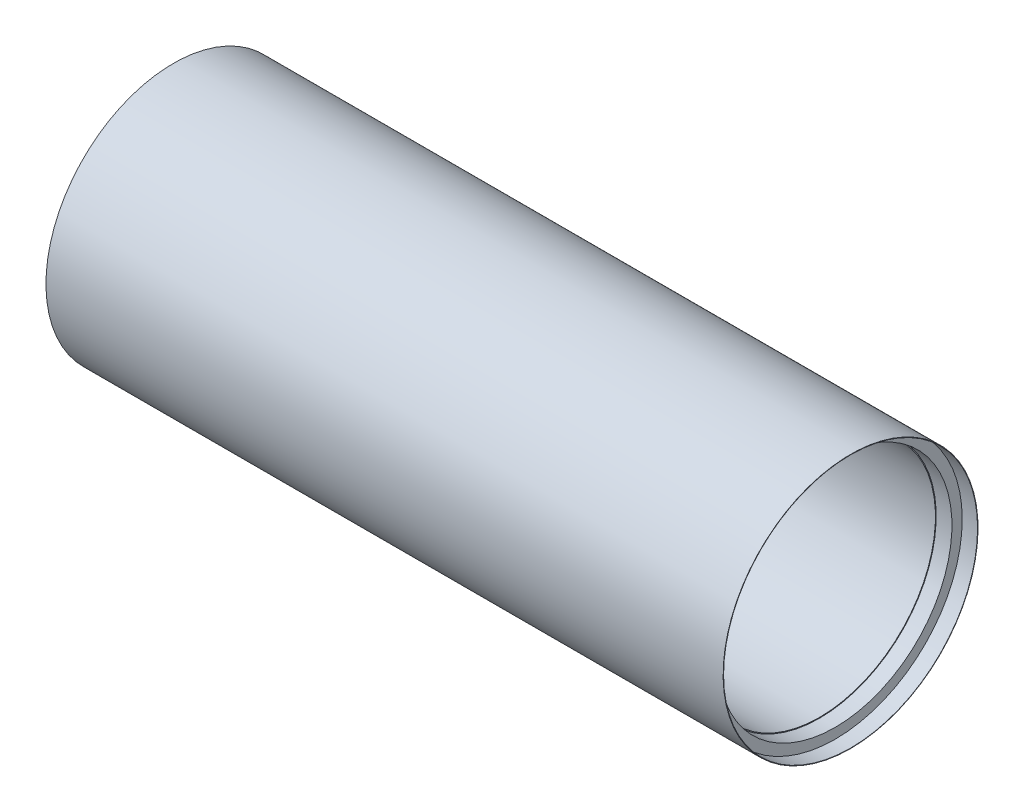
from build123d import *


with BuildPart() as part:
    # Sketch1 → Revolve1 (revolve)
    with BuildSketch(Plane.XY, mode=Mode.PRIVATE) as revolve1_sk:
        Polygon((0, 83.9724), (10.16, 83.9724), (10.16, 77.2414), (20.574, 77.2414), (20.574, 76.7334), (427.5582, 76.7334), (427.5582, 77.2414), (437.9722, 77.2414), (437.9722, 84.0486), (448.1322, 84.0486), (448.1322, 84.3534), (0, 84.3534), align=None)
    revolve(revolve1_sk.sketch.rotate(Axis((0, 0, 0), (1, 0, 0)), 180), axis=Axis((0, 0, 0), (1, 0, 0)))


solid = part.part
